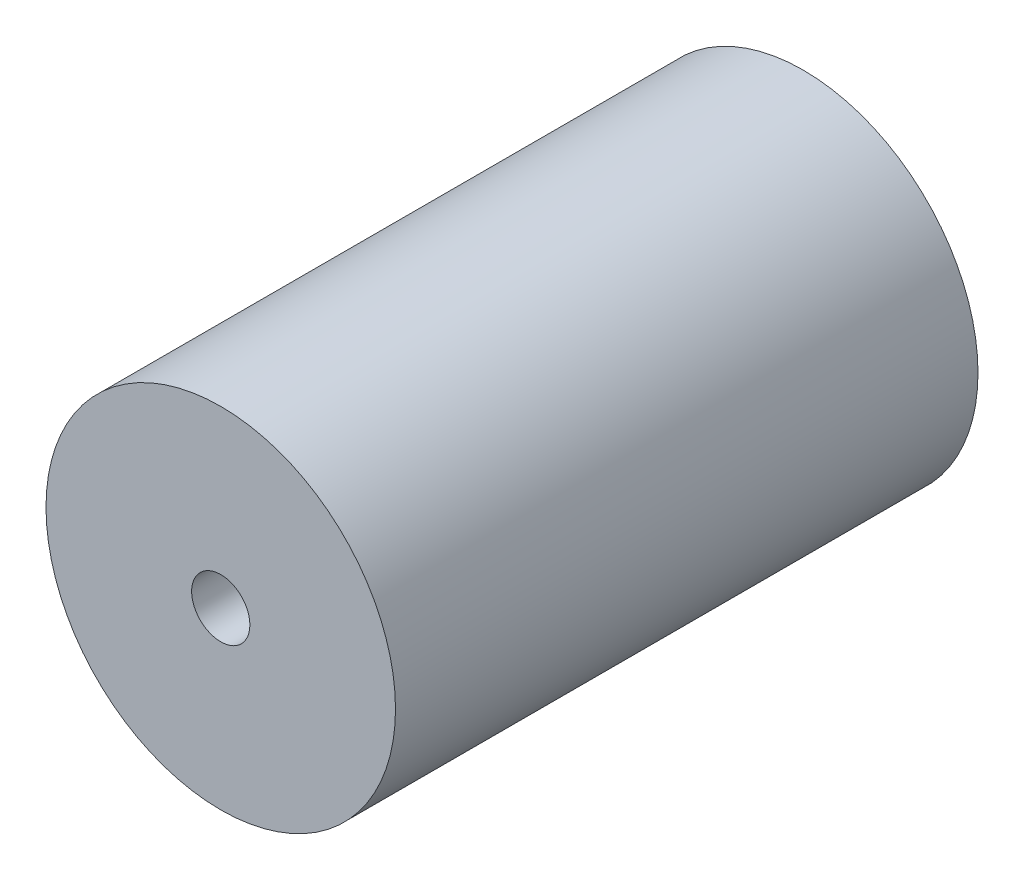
ISO-10303-21;
HEADER;
FILE_DESCRIPTION(('STEP AP214'),'2;1');
FILE_NAME('part.step','',(''),(''),'','','');
FILE_SCHEMA(('AUTOMOTIVE_DESIGN { 1 0 10303 214 1 1 1 1 }'));
ENDSEC;
DATA;
#1=APPLICATION_CONTEXT('core data for automotive mechanical design processes');
#2=APPLICATION_PROTOCOL_DEFINITION('international standard','automotive_design',2000,#1);
#3=PRODUCT_CONTEXT('',#1,'mechanical');
#4=PRODUCT('Part','Part','',(#3));
#5=PRODUCT_RELATED_PRODUCT_CATEGORY('part','',(#4));
#6=PRODUCT_DEFINITION_FORMATION('','',#4);
#7=PRODUCT_DEFINITION_CONTEXT('part definition',#1,'design');
#8=PRODUCT_DEFINITION('design','',#6,#7);
#9=PRODUCT_DEFINITION_SHAPE('','',#8);
#10=(LENGTH_UNIT() NAMED_UNIT(*) SI_UNIT(.MILLI.,.METRE.));
#11=(NAMED_UNIT(*) PLANE_ANGLE_UNIT() SI_UNIT($,.RADIAN.));
#12=(NAMED_UNIT(*) SI_UNIT($,.STERADIAN.) SOLID_ANGLE_UNIT());
#13=UNCERTAINTY_MEASURE_WITH_UNIT(LENGTH_MEASURE(1.E-05),#10,'distance_accuracy_value','');
#14=(GEOMETRIC_REPRESENTATION_CONTEXT(3) GLOBAL_UNCERTAINTY_ASSIGNED_CONTEXT((#13)) GLOBAL_UNIT_ASSIGNED_CONTEXT((#10,
#11,#12)) REPRESENTATION_CONTEXT('',''));
#15=CARTESIAN_POINT('',(0.,0.,0.));
#16=DIRECTION('',(0.,0.,1.));
#17=DIRECTION('',(1.,0.,0.));
#18=AXIS2_PLACEMENT_3D('',#15,#16,#17);
#19=CARTESIAN_POINT('',(0.,0.,50.));
#20=DIRECTION('',(0.,0.,-0.999999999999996));
#21=DIRECTION('',(-1.,0.,0.));
#22=AXIS2_PLACEMENT_3D('',#19,#20,#21);
#23=CYLINDRICAL_SURFACE('',#22,15.);
#24=CARTESIAN_POINT('',(0.,0.,50.));
#25=DIRECTION('',(0.,0.,0.999999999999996));
#26=DIRECTION('',(1.,0.,0.));
#27=AXIS2_PLACEMENT_3D('',#24,#25,#26);
#28=CIRCLE('',#27,15.);
#29=CARTESIAN_POINT('',(-15.,0.,50.));
#30=VERTEX_POINT('',#29);
#31=EDGE_CURVE('E11',#30,#30,#28,.T.);
#32=CARTESIAN_POINT('',(0.,0.,0.));
#33=DIRECTION('',(0.,0.,0.999999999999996));
#34=DIRECTION('',(1.,0.,0.));
#35=AXIS2_PLACEMENT_3D('',#32,#33,#34);
#36=CIRCLE('',#35,15.);
#37=CARTESIAN_POINT('',(-15.,0.,0.));
#38=VERTEX_POINT('',#37);
#39=EDGE_CURVE('E53',#38,#38,#36,.T.);
#40=CARTESIAN_POINT('',(-15.,0.,50.));
#41=CARTESIAN_POINT('',(-15.,0.,49.4791666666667));
#42=CARTESIAN_POINT('',(-15.,0.,48.9583333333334));
#43=CARTESIAN_POINT('',(-15.,0.,47.9166666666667));
#44=CARTESIAN_POINT('',(-15.,0.,47.3958333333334));
#45=CARTESIAN_POINT('',(-15.,0.,46.3541666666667));
#46=CARTESIAN_POINT('',(-15.,0.,45.8333333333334));
#47=CARTESIAN_POINT('',(-15.,0.,44.7916666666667));
#48=CARTESIAN_POINT('',(-15.,0.,44.2708333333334));
#49=CARTESIAN_POINT('',(-15.,0.,43.2291666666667));
#50=CARTESIAN_POINT('',(-15.,0.,42.7083333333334));
#51=CARTESIAN_POINT('',(-15.,0.,41.6666666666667));
#52=CARTESIAN_POINT('',(-15.,0.,41.1458333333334));
#53=CARTESIAN_POINT('',(-15.,0.,40.1041666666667));
#54=CARTESIAN_POINT('',(-15.,0.,39.5833333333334));
#55=CARTESIAN_POINT('',(-15.,0.,38.5416666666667));
#56=CARTESIAN_POINT('',(-15.,0.,38.0208333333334));
#57=CARTESIAN_POINT('',(-15.,0.,36.9791666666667));
#58=CARTESIAN_POINT('',(-15.,0.,36.4583333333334));
#59=CARTESIAN_POINT('',(-15.,0.,35.4166666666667));
#60=CARTESIAN_POINT('',(-15.,0.,34.8958333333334));
#61=CARTESIAN_POINT('',(-15.,0.,33.8541666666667));
#62=CARTESIAN_POINT('',(-15.,0.,33.3333333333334));
#63=CARTESIAN_POINT('',(-15.,0.,32.2916666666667));
#64=CARTESIAN_POINT('',(-15.,0.,31.7708333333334));
#65=CARTESIAN_POINT('',(-15.,0.,30.7291666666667));
#66=CARTESIAN_POINT('',(-15.,0.,30.2083333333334));
#67=CARTESIAN_POINT('',(-15.,0.,29.1666666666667));
#68=CARTESIAN_POINT('',(-15.,0.,28.6458333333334));
#69=CARTESIAN_POINT('',(-15.,0.,27.6041666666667));
#70=CARTESIAN_POINT('',(-15.,0.,27.0833333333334));
#71=CARTESIAN_POINT('',(-15.,0.,26.0416666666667));
#72=CARTESIAN_POINT('',(-15.,0.,25.5208333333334));
#73=CARTESIAN_POINT('',(-15.,0.,24.4791666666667));
#74=CARTESIAN_POINT('',(-15.,0.,23.9583333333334));
#75=CARTESIAN_POINT('',(-15.,0.,22.9166666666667));
#76=CARTESIAN_POINT('',(-15.,0.,22.3958333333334));
#77=CARTESIAN_POINT('',(-15.,0.,21.3541666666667));
#78=CARTESIAN_POINT('',(-15.,0.,20.8333333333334));
#79=CARTESIAN_POINT('',(-15.,0.,19.7916666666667));
#80=CARTESIAN_POINT('',(-15.,0.,19.2708333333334));
#81=CARTESIAN_POINT('',(-15.,0.,18.2291666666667));
#82=CARTESIAN_POINT('',(-15.,0.,17.7083333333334));
#83=CARTESIAN_POINT('',(-15.,0.,16.6666666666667));
#84=CARTESIAN_POINT('',(-15.,0.,16.1458333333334));
#85=CARTESIAN_POINT('',(-15.,0.,15.1041666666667));
#86=CARTESIAN_POINT('',(-15.,0.,14.5833333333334));
#87=CARTESIAN_POINT('',(-15.,0.,13.5416666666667));
#88=CARTESIAN_POINT('',(-15.,0.,13.0208333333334));
#89=CARTESIAN_POINT('',(-15.,0.,11.9791666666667));
#90=CARTESIAN_POINT('',(-15.,0.,11.4583333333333));
#91=CARTESIAN_POINT('',(-15.,0.,10.4166666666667));
#92=CARTESIAN_POINT('',(-15.,0.,9.89583333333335));
#93=CARTESIAN_POINT('',(-15.,0.,8.85416666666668));
#94=CARTESIAN_POINT('',(-15.,0.,8.33333333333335));
#95=CARTESIAN_POINT('',(-15.,0.,7.29166666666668));
#96=CARTESIAN_POINT('',(-15.,0.,6.77083333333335));
#97=CARTESIAN_POINT('',(-15.,0.,5.72916666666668));
#98=CARTESIAN_POINT('',(-15.,0.,5.20833333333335));
#99=CARTESIAN_POINT('',(-15.,0.,4.16666666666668));
#100=CARTESIAN_POINT('',(-15.,0.,3.64583333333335));
#101=CARTESIAN_POINT('',(-15.,0.,2.60416666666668));
#102=CARTESIAN_POINT('',(-15.,0.,2.08333333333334));
#103=CARTESIAN_POINT('',(-15.,0.,1.04166666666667));
#104=CARTESIAN_POINT('',(-15.,0.,0.52083333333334));
#105=CARTESIAN_POINT('',(-15.,0.,0.));
#106=B_SPLINE_CURVE_WITH_KNOTS('',3,(#40,#41,#42,#43,#44,#45,#46,#47,#48,#49,#50,#51,#52,#53,
#54,#55,#56,#57,#58,#59,#60,#61,#62,#63,#64,#65,#66,#67,#68,#69,#70,#71,#72,#73,#74,#75,#76,#77,
#78,#79,#80,#81,#82,#83,#84,#85,#86,#87,#88,#89,#90,#91,#92,#93,#94,#95,#96,#97,#98,#99,#100,
#101,#102,#103,#104,#105),.UNSPECIFIED.,.F.,.F.,(4,2,2,2,2,2,2,2,2,2,2,2,2,2,2,2,2,2,2,2,2,2,2,
2,2,2,2,2,2,2,2,2,4),(0.,1.5625,3.12500000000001,4.6875,6.25000000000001,7.81250000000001,
9.37500000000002,10.9375,12.5,14.0625,15.625,17.1875,18.75,20.3125,21.875,23.4375,25.,26.5625,
28.125,29.6875,31.25,32.8125,34.375,35.9375,37.5,39.0625,40.625,42.1875,43.75,45.3125,46.875,
48.4375,50.),.UNSPECIFIED.);
#107=EDGE_CURVE('BSEAM46',#30,#38,#106,.T.);
#108=ORIENTED_EDGE('',*,*,#31,.F.);
#109=ORIENTED_EDGE('',*,*,#39,.T.);
#110=ORIENTED_EDGE('',*,*,#107,.T.);
#111=ORIENTED_EDGE('',*,*,#107,.F.);
#112=EDGE_LOOP('',(#108,#110,#109,#111));
#113=FACE_BOUND('',#112,.T.);
#114=ADVANCED_FACE('F46',(#113),#23,.T.);
#115=CARTESIAN_POINT('',(0.,0.,50.));
#116=DIRECTION('',(0.,0.,0.999999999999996));
#117=DIRECTION('',(1.,0.,0.));
#118=AXIS2_PLACEMENT_3D('',#115,#116,#117);
#119=PLANE('',#118);
#120=CARTESIAN_POINT('',(0.,0.,50.));
#121=DIRECTION('',(0.,0.,0.999999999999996));
#122=DIRECTION('',(1.,0.,0.));
#123=AXIS2_PLACEMENT_3D('',#120,#121,#122);
#124=CIRCLE('',#123,2.5);
#125=CARTESIAN_POINT('',(2.5,0.,50.));
#126=VERTEX_POINT('',#125);
#127=EDGE_CURVE('E66',#126,#126,#124,.T.);
#128=ORIENTED_EDGE('',*,*,#127,.F.);
#129=EDGE_LOOP('',(#128));
#130=FACE_BOUND('',#129,.T.);
#131=ORIENTED_EDGE('',*,*,#31,.T.);
#132=EDGE_LOOP('',(#131));
#133=FACE_BOUND('',#132,.T.);
#134=ADVANCED_FACE('F78',(#130,#133),#119,.T.);
#135=CARTESIAN_POINT('',(0.,0.,0.));
#136=DIRECTION('',(0.,0.,0.999999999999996));
#137=DIRECTION('',(1.,0.,0.));
#138=AXIS2_PLACEMENT_3D('',#135,#136,#137);
#139=PLANE('',#138);
#140=ORIENTED_EDGE('',*,*,#39,.F.);
#141=EDGE_LOOP('',(#140));
#142=FACE_BOUND('',#141,.T.);
#143=ADVANCED_FACE('F76',(#142),#139,.F.);
#144=CARTESIAN_POINT('',(0.,0.,50.));
#145=DIRECTION('',(0.,0.,0.999999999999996));
#146=DIRECTION('',(1.,0.,0.));
#147=AXIS2_PLACEMENT_3D('',#144,#145,#146);
#148=CYLINDRICAL_SURFACE('',#147,2.5);
#149=CARTESIAN_POINT('',(0.,0.,32.));
#150=DIRECTION('',(0.,0.,0.999999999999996));
#151=DIRECTION('',(1.,0.,0.));
#152=AXIS2_PLACEMENT_3D('',#149,#150,#151);
#153=CIRCLE('',#152,2.5);
#154=CARTESIAN_POINT('',(2.5,0.,32.));
#155=VERTEX_POINT('',#154);
#156=EDGE_CURVE('E63',#155,#155,#153,.T.);
#157=CARTESIAN_POINT('',(2.5,0.,32.));
#158=CARTESIAN_POINT('',(2.5,0.,32.1875));
#159=CARTESIAN_POINT('',(2.5,0.,32.375));
#160=CARTESIAN_POINT('',(2.5,0.,32.75));
#161=CARTESIAN_POINT('',(2.5,0.,32.9375));
#162=CARTESIAN_POINT('',(2.5,0.,33.3125));
#163=CARTESIAN_POINT('',(2.5,0.,33.5));
#164=CARTESIAN_POINT('',(2.5,0.,33.875));
#165=CARTESIAN_POINT('',(2.5,0.,34.0625));
#166=CARTESIAN_POINT('',(2.5,0.,34.4375));
#167=CARTESIAN_POINT('',(2.5,0.,34.625));
#168=CARTESIAN_POINT('',(2.5,0.,35.));
#169=CARTESIAN_POINT('',(2.5,0.,35.1875));
#170=CARTESIAN_POINT('',(2.5,0.,35.5625));
#171=CARTESIAN_POINT('',(2.5,0.,35.75));
#172=CARTESIAN_POINT('',(2.5,0.,36.125));
#173=CARTESIAN_POINT('',(2.5,0.,36.3125));
#174=CARTESIAN_POINT('',(2.5,0.,36.6875));
#175=CARTESIAN_POINT('',(2.5,0.,36.875));
#176=CARTESIAN_POINT('',(2.5,0.,37.25));
#177=CARTESIAN_POINT('',(2.5,0.,37.4375));
#178=CARTESIAN_POINT('',(2.5,0.,37.8125));
#179=CARTESIAN_POINT('',(2.5,0.,38.));
#180=CARTESIAN_POINT('',(2.5,0.,38.375));
#181=CARTESIAN_POINT('',(2.5,0.,38.5625));
#182=CARTESIAN_POINT('',(2.5,0.,38.9375));
#183=CARTESIAN_POINT('',(2.5,0.,39.125));
#184=CARTESIAN_POINT('',(2.5,0.,39.5));
#185=CARTESIAN_POINT('',(2.5,0.,39.6875));
#186=CARTESIAN_POINT('',(2.5,0.,40.0625));
#187=CARTESIAN_POINT('',(2.5,0.,40.25));
#188=CARTESIAN_POINT('',(2.5,0.,40.625));
#189=CARTESIAN_POINT('',(2.5,0.,40.8125));
#190=CARTESIAN_POINT('',(2.5,0.,41.1875));
#191=CARTESIAN_POINT('',(2.5,0.,41.375));
#192=CARTESIAN_POINT('',(2.5,0.,41.75));
#193=CARTESIAN_POINT('',(2.5,0.,41.9375));
#194=CARTESIAN_POINT('',(2.5,0.,42.3125));
#195=CARTESIAN_POINT('',(2.5,0.,42.5));
#196=CARTESIAN_POINT('',(2.5,0.,42.875));
#197=CARTESIAN_POINT('',(2.5,0.,43.0625));
#198=CARTESIAN_POINT('',(2.5,0.,43.4375));
#199=CARTESIAN_POINT('',(2.5,0.,43.625));
#200=CARTESIAN_POINT('',(2.5,0.,44.));
#201=CARTESIAN_POINT('',(2.5,0.,44.1875));
#202=CARTESIAN_POINT('',(2.5,0.,44.5625));
#203=CARTESIAN_POINT('',(2.5,0.,44.75));
#204=CARTESIAN_POINT('',(2.5,0.,45.125));
#205=CARTESIAN_POINT('',(2.5,0.,45.3125));
#206=CARTESIAN_POINT('',(2.5,0.,45.6875));
#207=CARTESIAN_POINT('',(2.5,0.,45.875));
#208=CARTESIAN_POINT('',(2.5,0.,46.25));
#209=CARTESIAN_POINT('',(2.5,0.,46.4375));
#210=CARTESIAN_POINT('',(2.5,0.,46.8125));
#211=CARTESIAN_POINT('',(2.5,0.,47.));
#212=CARTESIAN_POINT('',(2.5,0.,47.375));
#213=CARTESIAN_POINT('',(2.5,0.,47.5625));
#214=CARTESIAN_POINT('',(2.5,0.,47.9375));
#215=CARTESIAN_POINT('',(2.5,0.,48.125));
#216=CARTESIAN_POINT('',(2.5,0.,48.5));
#217=CARTESIAN_POINT('',(2.5,0.,48.6875));
#218=CARTESIAN_POINT('',(2.5,0.,49.0625));
#219=CARTESIAN_POINT('',(2.5,0.,49.25));
#220=CARTESIAN_POINT('',(2.5,0.,49.625));
#221=CARTESIAN_POINT('',(2.5,0.,49.8125));
#222=CARTESIAN_POINT('',(2.5,0.,50.));
#223=B_SPLINE_CURVE_WITH_KNOTS('',3,(#157,#158,#159,#160,#161,#162,#163,#164,#165,#166,#167,
#168,#169,#170,#171,#172,#173,#174,#175,#176,#177,#178,#179,#180,#181,#182,#183,#184,#185,#186,
#187,#188,#189,#190,#191,#192,#193,#194,#195,#196,#197,#198,#199,#200,#201,#202,#203,#204,#205,
#206,#207,#208,#209,#210,#211,#212,#213,#214,#215,#216,#217,#218,#219,#220,#221,#222),
.UNSPECIFIED.,.F.,.F.,(4,2,2,2,2,2,2,2,2,2,2,2,2,2,2,2,2,2,2,2,2,2,2,2,2,2,2,2,2,2,2,2,4),(0.,
0.5625,1.12499999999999,1.6875,2.25,2.8125,3.375,3.9375,4.5,5.0625,5.62500000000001,
6.18750000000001,6.75000000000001,7.31250000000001,7.87500000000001,8.43750000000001,
9.00000000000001,9.56250000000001,10.125,10.6875,11.25,11.8125,12.375,12.9375,13.5,14.0625,
14.625,15.1875,15.75,16.3125,16.875,17.4375,18.),.UNSPECIFIED.);
#224=EDGE_CURVE('BSEAM59',#155,#126,#223,.T.);
#225=ORIENTED_EDGE('',*,*,#156,.F.);
#226=ORIENTED_EDGE('',*,*,#127,.T.);
#227=ORIENTED_EDGE('',*,*,#224,.T.);
#228=ORIENTED_EDGE('',*,*,#224,.F.);
#229=EDGE_LOOP('',(#225,#227,#226,#228));
#230=FACE_BOUND('',#229,.T.);
#231=ADVANCED_FACE('F59',(#230),#148,.F.);
#232=CARTESIAN_POINT('',(0.,0.,32.));
#233=DIRECTION('',(0.,0.,0.999999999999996));
#234=DIRECTION('',(1.,0.,0.));
#235=AXIS2_PLACEMENT_3D('',#232,#233,#234);
#236=CONICAL_SURFACE('',#235,2.5,1.02974425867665);
#237=CARTESIAN_POINT('',(0.,0.,30.4978484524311));
#238=VERTEX_POINT('',#237);
#239=VERTEX_LOOP('',#238);
#240=FACE_BOUND('',#239,.T.);
#241=ORIENTED_EDGE('',*,*,#156,.T.);
#242=EDGE_LOOP('',(#241));
#243=FACE_BOUND('',#242,.T.);
#244=ADVANCED_FACE('F56',(#240,#243),#236,.F.);
#245=CLOSED_SHELL('',(#114,#134,#143,#231,#244));
#246=MANIFOLD_SOLID_BREP('B2',#245);
#247=ADVANCED_BREP_SHAPE_REPRESENTATION('',(#18,#246),#14);
#248=SHAPE_DEFINITION_REPRESENTATION(#9,#247);
ENDSEC;
END-ISO-10303-21;
